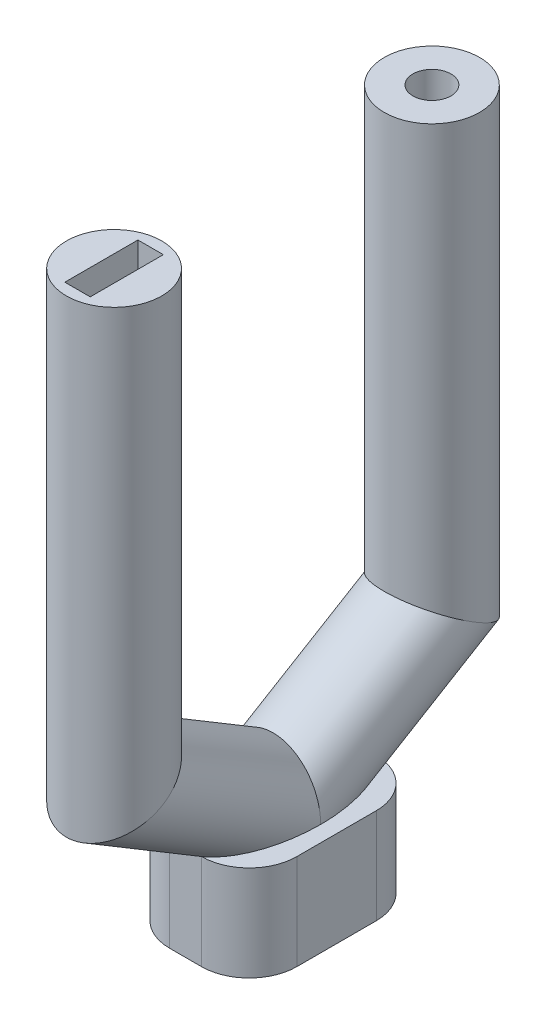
ISO-10303-21;
HEADER;
FILE_DESCRIPTION(('STEP AP214'),'2;1');
FILE_NAME('part.step','',(''),(''),'','','');
FILE_SCHEMA(('AUTOMOTIVE_DESIGN { 1 0 10303 214 1 1 1 1 }'));
ENDSEC;
DATA;
#1=APPLICATION_CONTEXT('core data for automotive mechanical design processes');
#2=APPLICATION_PROTOCOL_DEFINITION('international standard','automotive_design',2000,#1);
#3=PRODUCT_CONTEXT('',#1,'mechanical');
#4=PRODUCT('Part','Part','',(#3));
#5=PRODUCT_RELATED_PRODUCT_CATEGORY('part','',(#4));
#6=PRODUCT_DEFINITION_FORMATION('','',#4);
#7=PRODUCT_DEFINITION_CONTEXT('part definition',#1,'design');
#8=PRODUCT_DEFINITION('design','',#6,#7);
#9=PRODUCT_DEFINITION_SHAPE('','',#8);
#10=(LENGTH_UNIT() NAMED_UNIT(*) SI_UNIT(.MILLI.,.METRE.));
#11=(NAMED_UNIT(*) PLANE_ANGLE_UNIT() SI_UNIT($,.RADIAN.));
#12=(NAMED_UNIT(*) SI_UNIT($,.STERADIAN.) SOLID_ANGLE_UNIT());
#13=UNCERTAINTY_MEASURE_WITH_UNIT(LENGTH_MEASURE(1.E-05),#10,'distance_accuracy_value','');
#14=(GEOMETRIC_REPRESENTATION_CONTEXT(3) GLOBAL_UNCERTAINTY_ASSIGNED_CONTEXT((#13)) GLOBAL_UNIT_ASSIGNED_CONTEXT((#10,
#11,#12)) REPRESENTATION_CONTEXT('',''));
#15=CARTESIAN_POINT('',(0.,0.,0.));
#16=DIRECTION('',(0.,0.,1.));
#17=DIRECTION('',(1.,0.,0.));
#18=AXIS2_PLACEMENT_3D('',#15,#16,#17);
#19=CARTESIAN_POINT('',(0.,-169.,0.));
#20=DIRECTION('',(0.,-1.,0.));
#21=DIRECTION('',(0.,0.,-1.));
#22=AXIS2_PLACEMENT_3D('',#19,#20,#21);
#23=PLANE('',#22);
#24=CARTESIAN_POINT('',(0.,-169.,-50.));
#25=DIRECTION('',(0.,-1.,0.));
#26=DIRECTION('',(0.,0.,-1.));
#27=AXIS2_PLACEMENT_3D('',#24,#25,#26);
#28=CIRCLE('',#27,2.5);
#29=CARTESIAN_POINT('',(-2.5,-169.,-50.));
#30=VERTEX_POINT('',#29);
#31=CARTESIAN_POINT('',(2.5,-169.,-50.));
#32=VERTEX_POINT('',#31);
#33=EDGE_CURVE('E182',#30,#32,#28,.F.);
#34=ORIENTED_EDGE('',*,*,#33,.F.);
#35=CARTESIAN_POINT('',(0.,-169.,-50.0000000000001));
#36=DIRECTION('',(0.,-1.,0.));
#37=DIRECTION('',(0.,0.,-1.));
#38=AXIS2_PLACEMENT_3D('',#35,#36,#37);
#39=ELLIPSE('',#38,4.85912657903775,2.5);
#40=EDGE_CURVE('E195',#30,#32,#39,.F.);
#41=ORIENTED_EDGE('',*,*,#40,.T.);
#42=EDGE_LOOP('',(#34,#41));
#43=FACE_BOUND('',#42,.T.);
#44=ADVANCED_FACE('F64',(#43),#23,.F.);
#45=CARTESIAN_POINT('',(0.,-174.144957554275,-41.4250707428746));
#46=DIRECTION('',(0.,0.514495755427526,-0.857492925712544));
#47=DIRECTION('',(0.,0.857492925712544,0.514495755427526));
#48=AXIS2_PLACEMENT_3D('',#45,#46,#47);
#49=CYLINDRICAL_SURFACE('',#48,15.);
#50=CARTESIAN_POINT('',(0.,-139.,-100.));
#51=DIRECTION('',(0.,0.870199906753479,-0.492698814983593));
#52=DIRECTION('',(0.,-0.492698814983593,-0.870199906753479));
#53=AXIS2_PLACEMENT_3D('',#50,#51,#52);
#54=ELLIPSE('',#53,17.2374185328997,15.);
#55=CARTESIAN_POINT('',(0.,-147.492855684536,-115.));
#56=VERTEX_POINT('',#55);
#57=EDGE_CURVE('E299',#56,#56,#54,.F.);
#58=ORIENTED_EDGE('',*,*,#57,.T.);
#59=EDGE_LOOP('',(#58));
#60=FACE_BOUND('',#59,.T.);
#61=CARTESIAN_POINT('',(0.,-152.5,-77.5));
#62=DIRECTION('',(0.,0.,-1.));
#63=DIRECTION('',(0.,1.,0.));
#64=AXIS2_PLACEMENT_3D('',#61,#62,#63);
#65=ELLIPSE('',#64,17.4928556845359,15.);
#66=CARTESIAN_POINT('',(-4.98158373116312,-169.,-77.5));
#67=VERTEX_POINT('',#66);
#68=CARTESIAN_POINT('',(4.98158373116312,-169.,-77.5));
#69=VERTEX_POINT('',#68);
#70=EDGE_CURVE('E314',#67,#69,#65,.F.);
#71=ORIENTED_EDGE('',*,*,#70,.F.);
#72=CARTESIAN_POINT('',(0.,-169.,-50.0000000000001));
#73=DIRECTION('',(0.,-1.,0.));
#74=DIRECTION('',(0.,0.,-1.));
#75=AXIS2_PLACEMENT_3D('',#72,#73,#74);
#76=ELLIPSE('',#75,29.1547594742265,15.);
#77=CARTESIAN_POINT('',(-15.,-169.,-50.));
#78=VERTEX_POINT('',#77);
#79=EDGE_CURVE('E226',#67,#78,#76,.F.);
#80=ORIENTED_EDGE('',*,*,#79,.T.);
#81=CARTESIAN_POINT('',(0.,-169.,-50.));
#82=DIRECTION('',(0.,0.,-1.));
#83=DIRECTION('',(0.,-1.,0.));
#84=AXIS2_PLACEMENT_3D('',#81,#82,#83);
#85=ELLIPSE('',#84,17.4928556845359,15.);
#86=CARTESIAN_POINT('',(15.,-169.,-50.));
#87=VERTEX_POINT('',#86);
#88=EDGE_CURVE('E292',#87,#78,#85,.F.);
#89=ORIENTED_EDGE('',*,*,#88,.F.);
#90=EDGE_CURVE('E218',#87,#69,#76,.F.);
#91=ORIENTED_EDGE('',*,*,#90,.T.);
#92=EDGE_LOOP('',(#71,#80,#89,#91));
#93=FACE_BOUND('',#92,.T.);
#94=ADVANCED_FACE('F424',(#60,#93),#49,.T.);
#95=CARTESIAN_POINT('',(0.,-134.14205840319,8.09656932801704));
#96=DIRECTION('',(0.,-0.514495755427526,-0.857492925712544));
#97=DIRECTION('',(0.,0.857492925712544,-0.514495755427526));
#98=AXIS2_PLACEMENT_3D('',#95,#96,#97);
#99=CYLINDRICAL_SURFACE('',#98,15.);
#100=CARTESIAN_POINT('',(0.,-139.,0.));
#101=DIRECTION('',(0.,-0.870199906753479,-0.492698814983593));
#102=DIRECTION('',(0.,-0.492698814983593,0.870199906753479));
#103=AXIS2_PLACEMENT_3D('',#100,#101,#102);
#104=ELLIPSE('',#103,17.2374185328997,15.);
#105=CARTESIAN_POINT('',(0.,-147.492855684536,15.));
#106=VERTEX_POINT('',#105);
#107=EDGE_CURVE('E204',#106,#106,#104,.F.);
#108=ORIENTED_EDGE('',*,*,#107,.F.);
#109=EDGE_LOOP('',(#108));
#110=FACE_BOUND('',#109,.T.);
#111=ORIENTED_EDGE('',*,*,#88,.T.);
#112=CARTESIAN_POINT('',(0.,-169.,-50.));
#113=DIRECTION('',(0.,-1.,0.));
#114=DIRECTION('',(0.,0.,-1.));
#115=AXIS2_PLACEMENT_3D('',#112,#113,#114);
#116=ELLIPSE('',#115,29.1547594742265,15.);
#117=CARTESIAN_POINT('',(-4.981583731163,-169.,-22.5));
#118=VERTEX_POINT('',#117);
#119=EDGE_CURVE('E216',#78,#118,#116,.F.);
#120=ORIENTED_EDGE('',*,*,#119,.T.);
#121=CARTESIAN_POINT('',(0.,-152.5,-22.5));
#122=DIRECTION('',(0.,0.,1.));
#123=DIRECTION('',(0.,-1.,0.));
#124=AXIS2_PLACEMENT_3D('',#121,#122,#123);
#125=ELLIPSE('',#124,17.4928556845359,15.);
#126=CARTESIAN_POINT('',(4.981583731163,-169.,-22.5));
#127=VERTEX_POINT('',#126);
#128=EDGE_CURVE('E202',#127,#118,#125,.F.);
#129=ORIENTED_EDGE('',*,*,#128,.F.);
#130=EDGE_CURVE('E212',#127,#87,#116,.F.);
#131=ORIENTED_EDGE('',*,*,#130,.T.);
#132=EDGE_LOOP('',(#111,#120,#129,#131));
#133=FACE_BOUND('',#132,.T.);
#134=ADVANCED_FACE('F435',(#110,#133),#99,.T.);
#135=CARTESIAN_POINT('',(0.,-169.900367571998,-48.4993873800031));
#136=DIRECTION('',(0.,0.514495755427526,-0.857492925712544));
#137=DIRECTION('',(0.,0.857492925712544,0.514495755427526));
#138=AXIS2_PLACEMENT_3D('',#135,#136,#137);
#139=CYLINDRICAL_SURFACE('',#138,2.5);
#140=CARTESIAN_POINT('',(0.,-139.,-100.));
#141=DIRECTION('',(0.,0.870199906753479,-0.492698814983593));
#142=DIRECTION('',(0.,-0.492698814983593,-0.870199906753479));
#143=AXIS2_PLACEMENT_3D('',#140,#141,#142);
#144=ELLIPSE('',#143,2.87290308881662,2.5);
#145=CARTESIAN_POINT('',(0.,-140.415475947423,-102.5));
#146=VERTEX_POINT('',#145);
#147=EDGE_CURVE('E209',#146,#146,#144,.F.);
#148=ORIENTED_EDGE('',*,*,#147,.F.);
#149=EDGE_LOOP('',(#148));
#150=FACE_BOUND('',#149,.T.);
#151=CARTESIAN_POINT('',(0.,-169.,-50.0000000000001));
#152=DIRECTION('',(0.,-1.,0.));
#153=DIRECTION('',(0.,0.,-1.));
#154=AXIS2_PLACEMENT_3D('',#151,#152,#153);
#155=ELLIPSE('',#154,4.85912657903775,2.5);
#156=EDGE_CURVE('E207',#32,#30,#155,.F.);
#157=ORIENTED_EDGE('',*,*,#156,.F.);
#158=CARTESIAN_POINT('',(0.,-169.,-50.));
#159=DIRECTION('',(0.,0.,-1.));
#160=DIRECTION('',(0.,-1.,0.));
#161=AXIS2_PLACEMENT_3D('',#158,#159,#160);
#162=ELLIPSE('',#161,2.91547594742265,2.5);
#163=EDGE_CURVE('E198',#32,#30,#162,.F.);
#164=ORIENTED_EDGE('',*,*,#163,.T.);
#165=EDGE_LOOP('',(#157,#164));
#166=FACE_BOUND('',#165,.T.);
#167=ADVANCED_FACE('F203',(#150,#166),#139,.F.);
#168=CARTESIAN_POINT('',(0.,-138.147468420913,1.42088596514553));
#169=DIRECTION('',(0.,-0.514495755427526,-0.857492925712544));
#170=DIRECTION('',(0.,0.857492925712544,-0.514495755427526));
#171=AXIS2_PLACEMENT_3D('',#168,#169,#170);
#172=CYLINDRICAL_SURFACE('',#171,2.5);
#173=CARTESIAN_POINT('',(0.,-139.,0.));
#174=DIRECTION('',(0.,-0.870199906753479,-0.492698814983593));
#175=DIRECTION('',(0.,-0.492698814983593,0.870199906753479));
#176=AXIS2_PLACEMENT_3D('',#173,#174,#175);
#177=ELLIPSE('',#176,2.87290308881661,2.5);
#178=CARTESIAN_POINT('',(0.,-140.415475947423,2.49999999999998));
#179=VERTEX_POINT('',#178);
#180=EDGE_CURVE('E206',#179,#179,#177,.F.);
#181=ORIENTED_EDGE('',*,*,#180,.T.);
#182=EDGE_LOOP('',(#181));
#183=FACE_BOUND('',#182,.T.);
#184=ORIENTED_EDGE('',*,*,#40,.F.);
#185=ORIENTED_EDGE('',*,*,#163,.F.);
#186=EDGE_LOOP('',(#184,#185));
#187=FACE_BOUND('',#186,.T.);
#188=ADVANCED_FACE('F200',(#183,#187),#172,.F.);
#189=CARTESIAN_POINT('',(0.,0.,-100.));
#190=DIRECTION('',(0.,1.,0.));
#191=DIRECTION('',(0.,0.,1.));
#192=AXIS2_PLACEMENT_3D('',#189,#190,#191);
#193=PLANE('',#192);
#194=CARTESIAN_POINT('',(0.,0.,-100.));
#195=DIRECTION('',(0.,1.,0.));
#196=DIRECTION('',(0.,0.,1.));
#197=AXIS2_PLACEMENT_3D('',#194,#195,#196);
#198=CIRCLE('',#197,6.);
#199=CARTESIAN_POINT('',(0.,0.,-94.));
#200=VERTEX_POINT('',#199);
#201=EDGE_CURVE('E268',#200,#200,#198,.T.);
#202=ORIENTED_EDGE('',*,*,#201,.F.);
#203=EDGE_LOOP('',(#202));
#204=FACE_BOUND('',#203,.T.);
#205=CARTESIAN_POINT('',(0.,0.,-100.));
#206=DIRECTION('',(0.,1.,0.));
#207=DIRECTION('',(0.,0.,1.));
#208=AXIS2_PLACEMENT_3D('',#205,#206,#207);
#209=CIRCLE('',#208,15.);
#210=CARTESIAN_POINT('',(0.,0.,-85.));
#211=VERTEX_POINT('',#210);
#212=EDGE_CURVE('E284',#211,#211,#209,.T.);
#213=ORIENTED_EDGE('',*,*,#212,.T.);
#214=EDGE_LOOP('',(#213));
#215=FACE_BOUND('',#214,.T.);
#216=ADVANCED_FACE('F494',(#204,#215),#193,.T.);
#217=CARTESIAN_POINT('',(0.,0.,0.));
#218=DIRECTION('',(0.,-1.,0.));
#219=DIRECTION('',(0.,0.,-1.));
#220=AXIS2_PLACEMENT_3D('',#217,#218,#219);
#221=PLANE('',#220);
#222=DIRECTION('',(0.,0.,-1.));
#223=VECTOR('',#222,1.);
#224=CARTESIAN_POINT('',(-4.,0.,11.5));
#225=LINE('',#224,#223);
#226=CARTESIAN_POINT('',(-4.,0.,11.5));
#227=VERTEX_POINT('',#226);
#228=CARTESIAN_POINT('',(-4.,0.,-11.5));
#229=VERTEX_POINT('',#228);
#230=EDGE_CURVE('E253',#227,#229,#225,.T.);
#231=ORIENTED_EDGE('',*,*,#230,.T.);
#232=DIRECTION('',(-1.,0.,0.));
#233=VECTOR('',#232,1.);
#234=CARTESIAN_POINT('',(4.,0.,-11.5));
#235=LINE('',#234,#233);
#236=CARTESIAN_POINT('',(4.,0.,-11.5));
#237=VERTEX_POINT('',#236);
#238=EDGE_CURVE('E255',#237,#229,#235,.T.);
#239=ORIENTED_EDGE('',*,*,#238,.F.);
#240=DIRECTION('',(0.,0.,-1.));
#241=VECTOR('',#240,1.);
#242=CARTESIAN_POINT('',(4.,0.,11.5));
#243=LINE('',#242,#241);
#244=CARTESIAN_POINT('',(4.,0.,11.5));
#245=VERTEX_POINT('',#244);
#246=EDGE_CURVE('E241',#245,#237,#243,.T.);
#247=ORIENTED_EDGE('',*,*,#246,.F.);
#248=DIRECTION('',(-1.,0.,0.));
#249=VECTOR('',#248,1.);
#250=CARTESIAN_POINT('',(4.,0.,11.5));
#251=LINE('',#250,#249);
#252=EDGE_CURVE('E259',#245,#227,#251,.T.);
#253=ORIENTED_EDGE('',*,*,#252,.T.);
#254=EDGE_LOOP('',(#231,#239,#247,#253));
#255=FACE_BOUND('',#254,.T.);
#256=CARTESIAN_POINT('',(0.,0.,0.));
#257=DIRECTION('',(0.,-1.,0.));
#258=DIRECTION('',(0.,0.,-1.));
#259=AXIS2_PLACEMENT_3D('',#256,#257,#258);
#260=CIRCLE('',#259,15.);
#261=CARTESIAN_POINT('',(0.,0.,-15.));
#262=VERTEX_POINT('',#261);
#263=EDGE_CURVE('E290',#262,#262,#260,.T.);
#264=ORIENTED_EDGE('',*,*,#263,.F.);
#265=EDGE_LOOP('',(#264));
#266=FACE_BOUND('',#265,.T.);
#267=ADVANCED_FACE('F502',(#255,#266),#221,.F.);
#268=CARTESIAN_POINT('',(0.,-148.44214125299,-100.));
#269=DIRECTION('',(0.,1.,0.));
#270=DIRECTION('',(0.,0.,1.));
#271=AXIS2_PLACEMENT_3D('',#268,#269,#270);
#272=CYLINDRICAL_SURFACE('',#271,15.);
#273=ORIENTED_EDGE('',*,*,#57,.F.);
#274=EDGE_LOOP('',(#273));
#275=FACE_BOUND('',#274,.T.);
#276=ORIENTED_EDGE('',*,*,#212,.F.);
#277=EDGE_LOOP('',(#276));
#278=FACE_BOUND('',#277,.T.);
#279=ADVANCED_FACE('F500',(#275,#278),#272,.T.);
#280=CARTESIAN_POINT('',(0.,0.,0.));
#281=DIRECTION('',(0.,-1.,0.));
#282=DIRECTION('',(0.,0.,-1.));
#283=AXIS2_PLACEMENT_3D('',#280,#281,#282);
#284=CYLINDRICAL_SURFACE('',#283,15.);
#285=ORIENTED_EDGE('',*,*,#263,.T.);
#286=EDGE_LOOP('',(#285));
#287=FACE_BOUND('',#286,.T.);
#288=ORIENTED_EDGE('',*,*,#107,.T.);
#289=EDGE_LOOP('',(#288));
#290=FACE_BOUND('',#289,.T.);
#291=ADVANCED_FACE('F495',(#287,#290),#284,.T.);
#292=CARTESIAN_POINT('',(0.,-129.,-100.));
#293=DIRECTION('',(0.,1.,0.));
#294=DIRECTION('',(0.,0.,1.));
#295=AXIS2_PLACEMENT_3D('',#292,#293,#294);
#296=CYLINDRICAL_SURFACE('',#295,6.);
#297=CARTESIAN_POINT('',(0.,-129.,-100.));
#298=DIRECTION('',(0.,1.,0.));
#299=DIRECTION('',(0.,0.,1.));
#300=AXIS2_PLACEMENT_3D('',#297,#298,#299);
#301=CIRCLE('',#300,6.);
#302=CARTESIAN_POINT('',(0.,-129.,-94.));
#303=VERTEX_POINT('',#302);
#304=EDGE_CURVE('E279',#303,#303,#301,.T.);
#305=ORIENTED_EDGE('',*,*,#304,.F.);
#306=EDGE_LOOP('',(#305));
#307=FACE_BOUND('',#306,.T.);
#308=ORIENTED_EDGE('',*,*,#201,.T.);
#309=EDGE_LOOP('',(#308));
#310=FACE_BOUND('',#309,.T.);
#311=ADVANCED_FACE('F486',(#307,#310),#296,.F.);
#312=CARTESIAN_POINT('',(0.,-129.,-100.));
#313=DIRECTION('',(0.,1.,0.));
#314=DIRECTION('',(0.,0.,1.));
#315=AXIS2_PLACEMENT_3D('',#312,#313,#314);
#316=PLANE('',#315);
#317=CARTESIAN_POINT('',(0.,-129.,-100.));
#318=DIRECTION('',(0.,1.,0.));
#319=DIRECTION('',(0.,0.,1.));
#320=AXIS2_PLACEMENT_3D('',#317,#318,#319);
#321=CIRCLE('',#320,2.5);
#322=CARTESIAN_POINT('',(0.,-129.,-97.5));
#323=VERTEX_POINT('',#322);
#324=EDGE_CURVE('E256',#323,#323,#321,.T.);
#325=ORIENTED_EDGE('',*,*,#324,.F.);
#326=EDGE_LOOP('',(#325));
#327=FACE_BOUND('',#326,.T.);
#328=ORIENTED_EDGE('',*,*,#304,.T.);
#329=EDGE_LOOP('',(#328));
#330=FACE_BOUND('',#329,.T.);
#331=ADVANCED_FACE('F481',(#327,#330),#316,.T.);
#332=CARTESIAN_POINT('',(4.,-42.,-11.5));
#333=DIRECTION('',(0.,0.,-1.));
#334=DIRECTION('',(-1.,0.,0.));
#335=AXIS2_PLACEMENT_3D('',#332,#333,#334);
#336=PLANE('',#335);
#337=ORIENTED_EDGE('',*,*,#238,.T.);
#338=DIRECTION('',(0.,1.,0.));
#339=VECTOR('',#338,1.);
#340=CARTESIAN_POINT('',(-4.,-42.,-11.5));
#341=LINE('',#340,#339);
#342=CARTESIAN_POINT('',(-4.,-42.,-11.5));
#343=VERTEX_POINT('',#342);
#344=EDGE_CURVE('E252',#343,#229,#341,.T.);
#345=ORIENTED_EDGE('',*,*,#344,.F.);
#346=DIRECTION('',(-1.,0.,0.));
#347=VECTOR('',#346,1.);
#348=CARTESIAN_POINT('',(4.,-42.,-11.5));
#349=LINE('',#348,#347);
#350=CARTESIAN_POINT('',(4.,-42.,-11.5));
#351=VERTEX_POINT('',#350);
#352=EDGE_CURVE('E236',#351,#343,#349,.T.);
#353=ORIENTED_EDGE('',*,*,#352,.F.);
#354=DIRECTION('',(0.,1.,0.));
#355=VECTOR('',#354,1.);
#356=CARTESIAN_POINT('',(4.,-42.,-11.5));
#357=LINE('',#356,#355);
#358=EDGE_CURVE('E269',#351,#237,#357,.T.);
#359=ORIENTED_EDGE('',*,*,#358,.T.);
#360=EDGE_LOOP('',(#337,#345,#353,#359));
#361=FACE_BOUND('',#360,.T.);
#362=ADVANCED_FACE('F473',(#361),#336,.F.);
#363=CARTESIAN_POINT('',(4.,-42.,11.5));
#364=DIRECTION('',(1.,0.,0.));
#365=DIRECTION('',(0.,0.,-1.));
#366=AXIS2_PLACEMENT_3D('',#363,#364,#365);
#367=PLANE('',#366);
#368=ORIENTED_EDGE('',*,*,#246,.T.);
#369=ORIENTED_EDGE('',*,*,#358,.F.);
#370=DIRECTION('',(0.,0.,-1.));
#371=VECTOR('',#370,1.);
#372=CARTESIAN_POINT('',(4.,-42.,11.5));
#373=LINE('',#372,#371);
#374=CARTESIAN_POINT('',(4.,-42.,11.5));
#375=VERTEX_POINT('',#374);
#376=EDGE_CURVE('E250',#375,#351,#373,.T.);
#377=ORIENTED_EDGE('',*,*,#376,.F.);
#378=DIRECTION('',(0.,1.,0.));
#379=VECTOR('',#378,1.);
#380=CARTESIAN_POINT('',(4.,-42.,11.5));
#381=LINE('',#380,#379);
#382=EDGE_CURVE('E272',#375,#245,#381,.T.);
#383=ORIENTED_EDGE('',*,*,#382,.T.);
#384=EDGE_LOOP('',(#368,#369,#377,#383));
#385=FACE_BOUND('',#384,.T.);
#386=ADVANCED_FACE('F468',(#385),#367,.F.);
#387=CARTESIAN_POINT('',(4.,-42.,11.5));
#388=DIRECTION('',(0.,0.,-1.));
#389=DIRECTION('',(0.,1.,0.));
#390=AXIS2_PLACEMENT_3D('',#387,#388,#389);
#391=PLANE('',#390);
#392=ORIENTED_EDGE('',*,*,#252,.F.);
#393=ORIENTED_EDGE('',*,*,#382,.F.);
#394=DIRECTION('',(-1.,0.,0.));
#395=VECTOR('',#394,1.);
#396=CARTESIAN_POINT('',(4.,-42.,11.5));
#397=LINE('',#396,#395);
#398=CARTESIAN_POINT('',(-4.,-42.,11.5));
#399=VERTEX_POINT('',#398);
#400=EDGE_CURVE('E242',#375,#399,#397,.T.);
#401=ORIENTED_EDGE('',*,*,#400,.T.);
#402=DIRECTION('',(0.,1.,0.));
#403=VECTOR('',#402,1.);
#404=CARTESIAN_POINT('',(-4.,-42.,11.5));
#405=LINE('',#404,#403);
#406=EDGE_CURVE('E274',#399,#227,#405,.T.);
#407=ORIENTED_EDGE('',*,*,#406,.T.);
#408=EDGE_LOOP('',(#392,#393,#401,#407));
#409=FACE_BOUND('',#408,.T.);
#410=ADVANCED_FACE('F472',(#409),#391,.T.);
#411=CARTESIAN_POINT('',(-4.,-42.,11.5));
#412=DIRECTION('',(1.,0.,0.));
#413=DIRECTION('',(0.,0.,-1.));
#414=AXIS2_PLACEMENT_3D('',#411,#412,#413);
#415=PLANE('',#414);
#416=ORIENTED_EDGE('',*,*,#230,.F.);
#417=ORIENTED_EDGE('',*,*,#406,.F.);
#418=DIRECTION('',(0.,0.,-1.));
#419=VECTOR('',#418,1.);
#420=CARTESIAN_POINT('',(-4.,-42.,11.5));
#421=LINE('',#420,#419);
#422=EDGE_CURVE('E239',#399,#343,#421,.T.);
#423=ORIENTED_EDGE('',*,*,#422,.T.);
#424=ORIENTED_EDGE('',*,*,#344,.T.);
#425=EDGE_LOOP('',(#416,#417,#423,#424));
#426=FACE_BOUND('',#425,.T.);
#427=ADVANCED_FACE('F466',(#426),#415,.T.);
#428=CARTESIAN_POINT('',(0.,-42.,0.));
#429=DIRECTION('',(0.,-1.,0.));
#430=DIRECTION('',(0.,0.,-1.));
#431=AXIS2_PLACEMENT_3D('',#428,#429,#430);
#432=PLANE('',#431);
#433=CARTESIAN_POINT('',(0.,-42.,0.));
#434=DIRECTION('',(0.,-1.,0.));
#435=DIRECTION('',(0.,0.,-1.));
#436=AXIS2_PLACEMENT_3D('',#433,#434,#435);
#437=CIRCLE('',#436,2.5);
#438=CARTESIAN_POINT('',(0.,-42.,-2.50000000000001));
#439=VERTEX_POINT('',#438);
#440=EDGE_CURVE('E233',#439,#439,#437,.T.);
#441=ORIENTED_EDGE('',*,*,#440,.T.);
#442=EDGE_LOOP('',(#441));
#443=FACE_BOUND('',#442,.T.);
#444=ORIENTED_EDGE('',*,*,#352,.T.);
#445=ORIENTED_EDGE('',*,*,#422,.F.);
#446=ORIENTED_EDGE('',*,*,#400,.F.);
#447=ORIENTED_EDGE('',*,*,#376,.T.);
#448=EDGE_LOOP('',(#444,#445,#446,#447));
#449=FACE_BOUND('',#448,.T.);
#450=ADVANCED_FACE('F459',(#443,#449),#432,.F.);
#451=CARTESIAN_POINT('',(0.,0.,0.));
#452=DIRECTION('',(0.,-1.,0.));
#453=DIRECTION('',(0.,0.,-1.));
#454=AXIS2_PLACEMENT_3D('',#451,#452,#453);
#455=CYLINDRICAL_SURFACE('',#454,2.5);
#456=ORIENTED_EDGE('',*,*,#180,.F.);
#457=EDGE_LOOP('',(#456));
#458=FACE_BOUND('',#457,.T.);
#459=ORIENTED_EDGE('',*,*,#440,.F.);
#460=EDGE_LOOP('',(#459));
#461=FACE_BOUND('',#460,.T.);
#462=ADVANCED_FACE('F455',(#458,#461),#455,.F.);
#463=CARTESIAN_POINT('',(0.,-140.657023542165,-100.));
#464=DIRECTION('',(0.,1.,0.));
#465=DIRECTION('',(0.,0.,1.));
#466=AXIS2_PLACEMENT_3D('',#463,#464,#465);
#467=CYLINDRICAL_SURFACE('',#466,2.5);
#468=ORIENTED_EDGE('',*,*,#324,.T.);
#469=EDGE_LOOP('',(#468));
#470=FACE_BOUND('',#469,.T.);
#471=ORIENTED_EDGE('',*,*,#147,.T.);
#472=EDGE_LOOP('',(#471));
#473=FACE_BOUND('',#472,.T.);
#474=ADVANCED_FACE('F450',(#470,#473),#467,.F.);
#475=EDGE_CURVE('E177',#32,#30,#28,.F.);
#476=ORIENTED_EDGE('',*,*,#475,.F.);
#477=ORIENTED_EDGE('',*,*,#156,.T.);
#478=EDGE_LOOP('',(#476,#477));
#479=FACE_BOUND('',#478,.T.);
#480=ADVANCED_FACE('F211',(#479),#23,.F.);
#481=DIRECTION('',(-1.,0.,0.));
#482=VECTOR('',#481,1.);
#483=CARTESIAN_POINT('',(-20.,-169.,-77.5));
#484=LINE('',#483,#482);
#485=CARTESIAN_POINT('',(-4.99999999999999,-169.,-77.5));
#486=VERTEX_POINT('',#485);
#487=EDGE_CURVE('E383',#67,#486,#484,.T.);
#488=ORIENTED_EDGE('',*,*,#487,.T.);
#489=CARTESIAN_POINT('',(-4.99999999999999,-169.,-62.5));
#490=DIRECTION('',(0.,-1.,0.));
#491=DIRECTION('',(0.,0.,-1.));
#492=AXIS2_PLACEMENT_3D('',#489,#490,#491);
#493=CIRCLE('',#492,15.);
#494=CARTESIAN_POINT('',(-20.,-169.,-62.5));
#495=VERTEX_POINT('',#494);
#496=EDGE_CURVE('E329',#486,#495,#493,.F.);
#497=ORIENTED_EDGE('',*,*,#496,.T.);
#498=DIRECTION('',(0.,0.,1.));
#499=VECTOR('',#498,1.);
#500=CARTESIAN_POINT('',(-20.,-169.,-22.5));
#501=LINE('',#500,#499);
#502=CARTESIAN_POINT('',(-20.,-169.,-37.5));
#503=VERTEX_POINT('',#502);
#504=EDGE_CURVE('E380',#495,#503,#501,.T.);
#505=ORIENTED_EDGE('',*,*,#504,.T.);
#506=CARTESIAN_POINT('',(-4.99999999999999,-169.,-37.5));
#507=DIRECTION('',(0.,-1.,0.));
#508=DIRECTION('',(0.,0.,-1.));
#509=AXIS2_PLACEMENT_3D('',#506,#507,#508);
#510=CIRCLE('',#509,15.);
#511=CARTESIAN_POINT('',(-4.99999999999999,-169.,-22.5));
#512=VERTEX_POINT('',#511);
#513=EDGE_CURVE('E327',#503,#512,#510,.F.);
#514=ORIENTED_EDGE('',*,*,#513,.T.);
#515=DIRECTION('',(1.,0.,0.));
#516=VECTOR('',#515,1.);
#517=CARTESIAN_POINT('',(-20.,-169.,-22.5));
#518=LINE('',#517,#516);
#519=EDGE_CURVE('E213',#512,#118,#518,.T.);
#520=ORIENTED_EDGE('',*,*,#519,.T.);
#521=ORIENTED_EDGE('',*,*,#119,.F.);
#522=ORIENTED_EDGE('',*,*,#79,.F.);
#523=EDGE_LOOP('',(#488,#497,#505,#514,#520,#521,#522));
#524=FACE_BOUND('',#523,.T.);
#525=ADVANCED_FACE('F430',(#524),#23,.F.);
#526=CARTESIAN_POINT('',(0.,-199.,0.));
#527=DIRECTION('',(0.,-1.,0.));
#528=DIRECTION('',(0.,0.,-1.));
#529=AXIS2_PLACEMENT_3D('',#526,#527,#528);
#530=PLANE('',#529);
#531=CARTESIAN_POINT('',(0.,-199.,-50.));
#532=DIRECTION('',(0.,-1.,0.));
#533=DIRECTION('',(0.,0.,-1.));
#534=AXIS2_PLACEMENT_3D('',#531,#532,#533);
#535=CIRCLE('',#534,2.5);
#536=CARTESIAN_POINT('',(0.,-199.,-52.5));
#537=VERTEX_POINT('',#536);
#538=EDGE_CURVE('E193',#537,#537,#535,.F.);
#539=ORIENTED_EDGE('',*,*,#538,.T.);
#540=EDGE_LOOP('',(#539));
#541=FACE_BOUND('',#540,.T.);
#542=DIRECTION('',(0.,0.,1.));
#543=VECTOR('',#542,1.);
#544=CARTESIAN_POINT('',(-20.,-199.,-22.5));
#545=LINE('',#544,#543);
#546=CARTESIAN_POINT('',(-20.,-199.,-62.5));
#547=VERTEX_POINT('',#546);
#548=CARTESIAN_POINT('',(-20.,-199.,-37.5));
#549=VERTEX_POINT('',#548);
#550=EDGE_CURVE('E387',#547,#549,#545,.T.);
#551=ORIENTED_EDGE('',*,*,#550,.F.);
#552=CARTESIAN_POINT('',(-4.99999999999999,-199.,-62.5));
#553=DIRECTION('',(0.,-1.,0.));
#554=DIRECTION('',(0.,0.,-1.));
#555=AXIS2_PLACEMENT_3D('',#552,#553,#554);
#556=CIRCLE('',#555,15.);
#557=CARTESIAN_POINT('',(-4.99999999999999,-199.,-77.5));
#558=VERTEX_POINT('',#557);
#559=EDGE_CURVE('E348',#547,#558,#556,.T.);
#560=ORIENTED_EDGE('',*,*,#559,.T.);
#561=DIRECTION('',(-1.,0.,0.));
#562=VECTOR('',#561,1.);
#563=CARTESIAN_POINT('',(-20.,-199.,-77.5));
#564=LINE('',#563,#562);
#565=CARTESIAN_POINT('',(5.00000000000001,-199.,-77.5));
#566=VERTEX_POINT('',#565);
#567=EDGE_CURVE('E391',#566,#558,#564,.T.);
#568=ORIENTED_EDGE('',*,*,#567,.F.);
#569=CARTESIAN_POINT('',(5.00000000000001,-199.,-62.5));
#570=DIRECTION('',(0.,-1.,0.));
#571=DIRECTION('',(0.,0.,-1.));
#572=AXIS2_PLACEMENT_3D('',#569,#570,#571);
#573=CIRCLE('',#572,15.);
#574=CARTESIAN_POINT('',(20.,-199.,-62.5));
#575=VERTEX_POINT('',#574);
#576=EDGE_CURVE('E344',#566,#575,#573,.T.);
#577=ORIENTED_EDGE('',*,*,#576,.T.);
#578=DIRECTION('',(0.,0.,-1.));
#579=VECTOR('',#578,1.);
#580=CARTESIAN_POINT('',(20.,-199.,-22.5));
#581=LINE('',#580,#579);
#582=CARTESIAN_POINT('',(20.,-199.,-37.5));
#583=VERTEX_POINT('',#582);
#584=EDGE_CURVE('E402',#583,#575,#581,.T.);
#585=ORIENTED_EDGE('',*,*,#584,.F.);
#586=CARTESIAN_POINT('',(5.00000000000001,-199.,-37.5));
#587=DIRECTION('',(0.,-1.,0.));
#588=DIRECTION('',(0.,0.,-1.));
#589=AXIS2_PLACEMENT_3D('',#586,#587,#588);
#590=CIRCLE('',#589,15.);
#591=CARTESIAN_POINT('',(5.00000000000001,-199.,-22.5));
#592=VERTEX_POINT('',#591);
#593=EDGE_CURVE('E339',#583,#592,#590,.T.);
#594=ORIENTED_EDGE('',*,*,#593,.T.);
#595=DIRECTION('',(1.,0.,0.));
#596=VECTOR('',#595,1.);
#597=CARTESIAN_POINT('',(-20.,-199.,-22.5));
#598=LINE('',#597,#596);
#599=CARTESIAN_POINT('',(-4.99999999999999,-199.,-22.5));
#600=VERTEX_POINT('',#599);
#601=EDGE_CURVE('E368',#600,#592,#598,.T.);
#602=ORIENTED_EDGE('',*,*,#601,.F.);
#603=CARTESIAN_POINT('',(-4.99999999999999,-199.,-37.5));
#604=DIRECTION('',(0.,-1.,0.));
#605=DIRECTION('',(0.,0.,-1.));
#606=AXIS2_PLACEMENT_3D('',#603,#604,#605);
#607=CIRCLE('',#606,15.);
#608=EDGE_CURVE('E345',#600,#549,#607,.T.);
#609=ORIENTED_EDGE('',*,*,#608,.T.);
#610=EDGE_LOOP('',(#551,#560,#568,#577,#585,#594,#602,#609));
#611=FACE_BOUND('',#610,.T.);
#612=ADVANCED_FACE('F414',(#541,#611),#530,.T.);
#613=DIRECTION('',(0.,0.,-1.));
#614=VECTOR('',#613,1.);
#615=CARTESIAN_POINT('',(20.,-169.,-22.5));
#616=LINE('',#615,#614);
#617=CARTESIAN_POINT('',(20.,-169.,-37.5));
#618=VERTEX_POINT('',#617);
#619=CARTESIAN_POINT('',(20.,-169.,-62.5));
#620=VERTEX_POINT('',#619);
#621=EDGE_CURVE('E389',#618,#620,#616,.T.);
#622=ORIENTED_EDGE('',*,*,#621,.T.);
#623=CARTESIAN_POINT('',(5.00000000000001,-169.,-62.5));
#624=DIRECTION('',(0.,-1.,0.));
#625=DIRECTION('',(0.,0.,-1.));
#626=AXIS2_PLACEMENT_3D('',#623,#624,#625);
#627=CIRCLE('',#626,15.);
#628=CARTESIAN_POINT('',(5.00000000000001,-169.,-77.5));
#629=VERTEX_POINT('',#628);
#630=EDGE_CURVE('E89',#620,#629,#627,.F.);
#631=ORIENTED_EDGE('',*,*,#630,.T.);
#632=EDGE_CURVE('E379',#629,#69,#484,.T.);
#633=ORIENTED_EDGE('',*,*,#632,.T.);
#634=ORIENTED_EDGE('',*,*,#90,.F.);
#635=ORIENTED_EDGE('',*,*,#130,.F.);
#636=CARTESIAN_POINT('',(5.00000000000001,-169.,-22.5));
#637=VERTEX_POINT('',#636);
#638=EDGE_CURVE('E222',#127,#637,#518,.T.);
#639=ORIENTED_EDGE('',*,*,#638,.T.);
#640=CARTESIAN_POINT('',(5.00000000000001,-169.,-37.5));
#641=DIRECTION('',(0.,-1.,0.));
#642=DIRECTION('',(0.,0.,-1.));
#643=AXIS2_PLACEMENT_3D('',#640,#641,#642);
#644=CIRCLE('',#643,15.);
#645=EDGE_CURVE('E81',#637,#618,#644,.F.);
#646=ORIENTED_EDGE('',*,*,#645,.T.);
#647=EDGE_LOOP('',(#622,#631,#633,#634,#635,#639,#646));
#648=FACE_BOUND('',#647,.T.);
#649=ADVANCED_FACE('F373',(#648),#23,.F.);
#650=CARTESIAN_POINT('',(20.,-199.,-22.5));
#651=DIRECTION('',(1.,0.,0.));
#652=DIRECTION('',(0.,0.,-1.));
#653=AXIS2_PLACEMENT_3D('',#650,#651,#652);
#654=PLANE('',#653);
#655=ORIENTED_EDGE('',*,*,#584,.T.);
#656=DIRECTION('',(0.,1.,0.));
#657=VECTOR('',#656,1.);
#658=CARTESIAN_POINT('',(20.,-199.,-62.5));
#659=LINE('',#658,#657);
#660=EDGE_CURVE('E351',#575,#620,#659,.T.);
#661=ORIENTED_EDGE('',*,*,#660,.T.);
#662=ORIENTED_EDGE('',*,*,#621,.F.);
#663=DIRECTION('',(0.,1.,0.));
#664=VECTOR('',#663,1.);
#665=CARTESIAN_POINT('',(20.,-199.,-37.5));
#666=LINE('',#665,#664);
#667=EDGE_CURVE('E352',#618,#583,#666,.F.);
#668=ORIENTED_EDGE('',*,*,#667,.T.);
#669=EDGE_LOOP('',(#655,#661,#662,#668));
#670=FACE_BOUND('',#669,.T.);
#671=ADVANCED_FACE('F437',(#670),#654,.T.);
#672=CARTESIAN_POINT('',(-20.,-199.,-77.5));
#673=DIRECTION('',(0.,0.,-1.));
#674=DIRECTION('',(0.,1.,0.));
#675=AXIS2_PLACEMENT_3D('',#672,#673,#674);
#676=PLANE('',#675);
#677=ORIENTED_EDGE('',*,*,#567,.T.);
#678=DIRECTION('',(0.,1.,0.));
#679=VECTOR('',#678,1.);
#680=CARTESIAN_POINT('',(-4.99999999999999,-199.,-77.5));
#681=LINE('',#680,#679);
#682=EDGE_CURVE('E325',#558,#486,#681,.T.);
#683=ORIENTED_EDGE('',*,*,#682,.T.);
#684=ORIENTED_EDGE('',*,*,#487,.F.);
#685=ORIENTED_EDGE('',*,*,#70,.T.);
#686=ORIENTED_EDGE('',*,*,#632,.F.);
#687=DIRECTION('',(0.,1.,0.));
#688=VECTOR('',#687,1.);
#689=CARTESIAN_POINT('',(5.00000000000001,-199.,-77.5));
#690=LINE('',#689,#688);
#691=EDGE_CURVE('E316',#629,#566,#690,.F.);
#692=ORIENTED_EDGE('',*,*,#691,.T.);
#693=EDGE_LOOP('',(#677,#683,#684,#685,#686,#692));
#694=FACE_BOUND('',#693,.T.);
#695=ADVANCED_FACE('F442',(#694),#676,.T.);
#696=CARTESIAN_POINT('',(-20.,-199.,-22.5));
#697=DIRECTION('',(-1.,0.,0.));
#698=DIRECTION('',(0.,0.,1.));
#699=AXIS2_PLACEMENT_3D('',#696,#697,#698);
#700=PLANE('',#699);
#701=ORIENTED_EDGE('',*,*,#504,.F.);
#702=DIRECTION('',(0.,1.,0.));
#703=VECTOR('',#702,1.);
#704=CARTESIAN_POINT('',(-20.,-199.,-62.5));
#705=LINE('',#704,#703);
#706=EDGE_CURVE('E337',#495,#547,#705,.F.);
#707=ORIENTED_EDGE('',*,*,#706,.T.);
#708=ORIENTED_EDGE('',*,*,#550,.T.);
#709=DIRECTION('',(0.,1.,0.));
#710=VECTOR('',#709,1.);
#711=CARTESIAN_POINT('',(-20.,-199.,-37.5));
#712=LINE('',#711,#710);
#713=EDGE_CURVE('E334',#549,#503,#712,.T.);
#714=ORIENTED_EDGE('',*,*,#713,.T.);
#715=EDGE_LOOP('',(#701,#707,#708,#714));
#716=FACE_BOUND('',#715,.T.);
#717=ADVANCED_FACE('F538',(#716),#700,.T.);
#718=CARTESIAN_POINT('',(-20.,-199.,-22.5));
#719=DIRECTION('',(0.,0.,1.));
#720=DIRECTION('',(0.,-1.,0.));
#721=AXIS2_PLACEMENT_3D('',#718,#719,#720);
#722=PLANE('',#721);
#723=ORIENTED_EDGE('',*,*,#519,.F.);
#724=DIRECTION('',(0.,1.,0.));
#725=VECTOR('',#724,1.);
#726=CARTESIAN_POINT('',(-4.99999999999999,-199.,-22.5));
#727=LINE('',#726,#725);
#728=EDGE_CURVE('E12',#512,#600,#727,.F.);
#729=ORIENTED_EDGE('',*,*,#728,.T.);
#730=ORIENTED_EDGE('',*,*,#601,.T.);
#731=DIRECTION('',(0.,1.,0.));
#732=VECTOR('',#731,1.);
#733=CARTESIAN_POINT('',(5.00000000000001,-199.,-22.5));
#734=LINE('',#733,#732);
#735=EDGE_CURVE('E71',#592,#637,#734,.T.);
#736=ORIENTED_EDGE('',*,*,#735,.T.);
#737=ORIENTED_EDGE('',*,*,#638,.F.);
#738=ORIENTED_EDGE('',*,*,#128,.T.);
#739=EDGE_LOOP('',(#723,#729,#730,#736,#737,#738));
#740=FACE_BOUND('',#739,.T.);
#741=ADVANCED_FACE('F366',(#740),#722,.T.);
#742=CARTESIAN_POINT('',(-4.99999999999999,-199.,-62.5));
#743=DIRECTION('',(0.,1.,0.));
#744=DIRECTION('',(0.,0.,1.));
#745=AXIS2_PLACEMENT_3D('',#742,#743,#744);
#746=CYLINDRICAL_SURFACE('',#745,15.);
#747=ORIENTED_EDGE('',*,*,#559,.F.);
#748=ORIENTED_EDGE('',*,*,#706,.F.);
#749=ORIENTED_EDGE('',*,*,#496,.F.);
#750=ORIENTED_EDGE('',*,*,#682,.F.);
#751=EDGE_LOOP('',(#747,#748,#749,#750));
#752=FACE_BOUND('',#751,.T.);
#753=ADVANCED_FACE('F444',(#752),#746,.T.);
#754=CARTESIAN_POINT('',(5.00000000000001,-199.,-62.5));
#755=DIRECTION('',(0.,1.,0.));
#756=DIRECTION('',(0.,0.,1.));
#757=AXIS2_PLACEMENT_3D('',#754,#755,#756);
#758=CYLINDRICAL_SURFACE('',#757,15.);
#759=ORIENTED_EDGE('',*,*,#576,.F.);
#760=ORIENTED_EDGE('',*,*,#691,.F.);
#761=ORIENTED_EDGE('',*,*,#630,.F.);
#762=ORIENTED_EDGE('',*,*,#660,.F.);
#763=EDGE_LOOP('',(#759,#760,#761,#762));
#764=FACE_BOUND('',#763,.T.);
#765=ADVANCED_FACE('F511',(#764),#758,.T.);
#766=CARTESIAN_POINT('',(-4.99999999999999,-199.,-37.5));
#767=DIRECTION('',(0.,1.,0.));
#768=DIRECTION('',(0.,0.,1.));
#769=AXIS2_PLACEMENT_3D('',#766,#767,#768);
#770=CYLINDRICAL_SURFACE('',#769,15.);
#771=ORIENTED_EDGE('',*,*,#608,.F.);
#772=ORIENTED_EDGE('',*,*,#728,.F.);
#773=ORIENTED_EDGE('',*,*,#513,.F.);
#774=ORIENTED_EDGE('',*,*,#713,.F.);
#775=EDGE_LOOP('',(#771,#772,#773,#774));
#776=FACE_BOUND('',#775,.T.);
#777=ADVANCED_FACE('F422',(#776),#770,.T.);
#778=CARTESIAN_POINT('',(5.00000000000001,-199.,-37.5));
#779=DIRECTION('',(0.,1.,0.));
#780=DIRECTION('',(0.,0.,1.));
#781=AXIS2_PLACEMENT_3D('',#778,#779,#780);
#782=CYLINDRICAL_SURFACE('',#781,15.);
#783=ORIENTED_EDGE('',*,*,#593,.F.);
#784=ORIENTED_EDGE('',*,*,#667,.F.);
#785=ORIENTED_EDGE('',*,*,#645,.F.);
#786=ORIENTED_EDGE('',*,*,#735,.F.);
#787=EDGE_LOOP('',(#783,#784,#785,#786));
#788=FACE_BOUND('',#787,.T.);
#789=ADVANCED_FACE('F70',(#788),#782,.T.);
#790=CARTESIAN_POINT('',(0.,-165.,-50.));
#791=DIRECTION('',(0.,-1.,0.));
#792=DIRECTION('',(0.,0.,-1.));
#793=AXIS2_PLACEMENT_3D('',#790,#791,#792);
#794=CYLINDRICAL_SURFACE('',#793,2.5);
#795=ORIENTED_EDGE('',*,*,#33,.T.);
#796=ORIENTED_EDGE('',*,*,#475,.T.);
#797=EDGE_LOOP('',(#795,#796));
#798=FACE_BOUND('',#797,.T.);
#799=ORIENTED_EDGE('',*,*,#538,.F.);
#800=EDGE_LOOP('',(#799));
#801=FACE_BOUND('',#800,.T.);
#802=ADVANCED_FACE('F181',(#798,#801),#794,.F.);
#803=CLOSED_SHELL('',(#44,#94,#134,#167,#188,#216,#267,#279,#291,#311,#331,#362,#386,#410,#427,
#450,#462,#474,#480,#525,#612,#649,#671,#695,#717,#741,#753,#765,#777,#789,#802));
#804=MANIFOLD_SOLID_BREP('B2',#803);
#805=ADVANCED_BREP_SHAPE_REPRESENTATION('',(#18,#804),#14);
#806=SHAPE_DEFINITION_REPRESENTATION(#9,#805);
ENDSEC;
END-ISO-10303-21;
